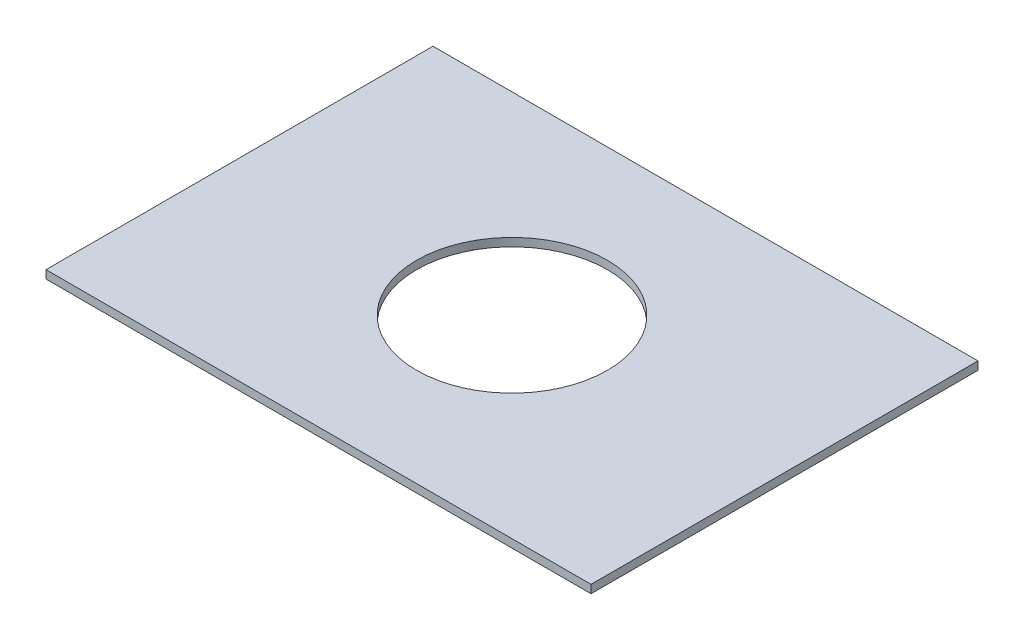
from build123d import *

# Parameters (mm, degrees)
ESQUISSE1_W             = 103
ESQUISSE1_H             = 75
BOSS_EXTRU_1_DEPTH      = 1.5
ESQUISSE3_W             = 103
ESQUISSE3_H             = 75
ESQUISSE3_W_2           = 100
ESQUISSE3_H_2           = 72
ENL_V_MAT_EXTRU_1_DEPTH = 10
ESQUISSE6_W             = 100
ESQUISSE6_H             = 1
ENL_V_MAT_EXTRU_3_DEPTH = 10
ESQUISSE7_R             = 17.5
ENL_V_MAT_EXTRU_4_DEPTH = 10


with BuildPart() as part:
    # Esquisse1 → Boss.-Extru.1 (new body)
    with BuildSketch(Plane(origin=(0, 0, 0), x_dir=(1, 0, 0), z_dir=(0, 1, 0))):
        with Locations((51.5, 37.5)):
            Rectangle(ESQUISSE1_W, ESQUISSE1_H)
    extrude(amount=BOSS_EXTRU_1_DEPTH)

    # Esquisse3 → Enl_v. mat.-Extru.1 (cut)
    with BuildSketch(Plane(origin=(0, 1.5, 0), x_dir=(1, 0, 0), z_dir=(0, 1, 0))):
        with Locations((51.5, 37.5)):
            Rectangle(ESQUISSE3_W, ESQUISSE3_H)
        with Locations((51.5, 37.5)):
            Rectangle(ESQUISSE3_W_2, ESQUISSE3_H_2, mode=Mode.SUBTRACT)
    extrude(amount=-ENL_V_MAT_EXTRU_1_DEPTH, mode=Mode.SUBTRACT)

    # Esquisse6 → Enl_v. mat.-Extru.3 (cut)
    with BuildSketch(Plane(origin=(0, 1.5, 0), x_dir=(1, 0, 0), z_dir=(0, 1, 0))):
        with Locations((51.5, 73)):
            Rectangle(ESQUISSE6_W, ESQUISSE6_H)
    extrude(amount=-ENL_V_MAT_EXTRU_3_DEPTH, mode=Mode.SUBTRACT)

    # Esquisse7 → Enl_v. mat.-Extru.4 (cut)
    with BuildSketch(Plane(origin=(0, 1.5, 0), x_dir=(1, 0, 0), z_dir=(0, 1, 0))):
        with Locations(Location((51.5, 37, 0), (0, 0, 270))):
            Circle(ESQUISSE7_R)
    extrude(amount=-ENL_V_MAT_EXTRU_4_DEPTH, mode=Mode.SUBTRACT)


solid = part.part
